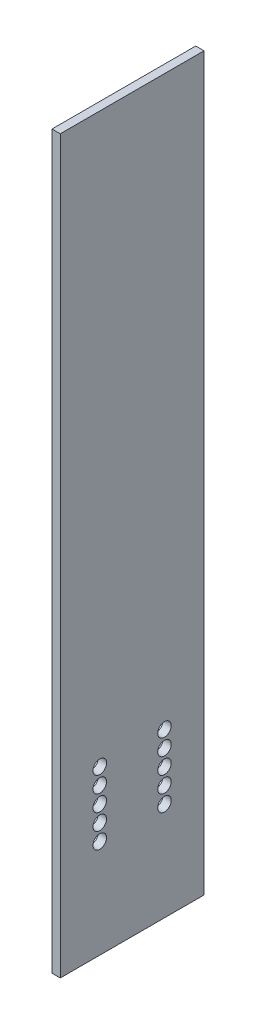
ISO-10303-21;
HEADER;
FILE_DESCRIPTION(('STEP AP214'),'2;1');
FILE_NAME('part.step','',(''),(''),'','','');
FILE_SCHEMA(('AUTOMOTIVE_DESIGN { 1 0 10303 214 1 1 1 1 }'));
ENDSEC;
DATA;
#1=APPLICATION_CONTEXT('core data for automotive mechanical design processes');
#2=APPLICATION_PROTOCOL_DEFINITION('international standard','automotive_design',2000,#1);
#3=PRODUCT_CONTEXT('',#1,'mechanical');
#4=PRODUCT('Part','Part','',(#3));
#5=PRODUCT_RELATED_PRODUCT_CATEGORY('part','',(#4));
#6=PRODUCT_DEFINITION_FORMATION('','',#4);
#7=PRODUCT_DEFINITION_CONTEXT('part definition',#1,'design');
#8=PRODUCT_DEFINITION('design','',#6,#7);
#9=PRODUCT_DEFINITION_SHAPE('','',#8);
#10=(LENGTH_UNIT() NAMED_UNIT(*) SI_UNIT(.MILLI.,.METRE.));
#11=(NAMED_UNIT(*) PLANE_ANGLE_UNIT() SI_UNIT($,.RADIAN.));
#12=(NAMED_UNIT(*) SI_UNIT($,.STERADIAN.) SOLID_ANGLE_UNIT());
#13=UNCERTAINTY_MEASURE_WITH_UNIT(LENGTH_MEASURE(1.E-05),#10,'distance_accuracy_value','');
#14=(GEOMETRIC_REPRESENTATION_CONTEXT(3) GLOBAL_UNCERTAINTY_ASSIGNED_CONTEXT((#13)) GLOBAL_UNIT_ASSIGNED_CONTEXT((#10,
#11,#12)) REPRESENTATION_CONTEXT('',''));
#15=CARTESIAN_POINT('',(0.,0.,0.));
#16=DIRECTION('',(0.,0.,1.));
#17=DIRECTION('',(1.,0.,0.));
#18=AXIS2_PLACEMENT_3D('',#15,#16,#17);
#19=CARTESIAN_POINT('',(3.2512,0.,0.));
#20=DIRECTION('',(1.,0.,0.));
#21=DIRECTION('',(0.,0.,-1.));
#22=AXIS2_PLACEMENT_3D('',#19,#20,#21);
#23=PLANE('',#22);
#24=CARTESIAN_POINT('',(3.2512,-79.4512,12.7));
#25=DIRECTION('',(-1.,0.,0.));
#26=DIRECTION('',(0.,0.,1.));
#27=AXIS2_PLACEMENT_3D('',#24,#25,#26);
#28=CIRCLE('',#27,2.6543);
#29=CARTESIAN_POINT('',(3.2512,-79.4512,15.3543));
#30=VERTEX_POINT('',#29);
#31=EDGE_CURVE('E193',#30,#30,#28,.T.);
#32=ORIENTED_EDGE('',*,*,#31,.T.);
#33=EDGE_LOOP('',(#32));
#34=FACE_BOUND('',#33,.T.);
#35=CARTESIAN_POINT('',(3.2512,-85.8012,12.7));
#36=DIRECTION('',(-1.,0.,0.));
#37=DIRECTION('',(0.,0.,1.));
#38=AXIS2_PLACEMENT_3D('',#35,#36,#37);
#39=CIRCLE('',#38,2.6543);
#40=CARTESIAN_POINT('',(3.2512,-85.8012,15.3543));
#41=VERTEX_POINT('',#40);
#42=EDGE_CURVE('E177',#41,#41,#39,.T.);
#43=ORIENTED_EDGE('',*,*,#42,.T.);
#44=EDGE_LOOP('',(#43));
#45=FACE_BOUND('',#44,.T.);
#46=DIRECTION('',(0.,1.,0.));
#47=VECTOR('',#46,1.);
#48=CARTESIAN_POINT('',(3.2512,143.51,-28.2194));
#49=LINE('',#48,#47);
#50=CARTESIAN_POINT('',(3.2512,-143.51,-28.2194));
#51=VERTEX_POINT('',#50);
#52=CARTESIAN_POINT('',(3.2512,143.51,-28.2194));
#53=VERTEX_POINT('',#52);
#54=EDGE_CURVE('E92',#51,#53,#49,.T.);
#55=ORIENTED_EDGE('',*,*,#54,.T.);
#56=DIRECTION('',(0.,0.,1.));
#57=VECTOR('',#56,1.);
#58=CARTESIAN_POINT('',(3.2512,143.51,28.2194));
#59=LINE('',#58,#57);
#60=CARTESIAN_POINT('',(3.2512,143.51,28.2194));
#61=VERTEX_POINT('',#60);
#62=EDGE_CURVE('E87',#53,#61,#59,.T.);
#63=ORIENTED_EDGE('',*,*,#62,.T.);
#64=DIRECTION('',(0.,-1.,0.));
#65=VECTOR('',#64,1.);
#66=CARTESIAN_POINT('',(3.2512,143.51,28.2194));
#67=LINE('',#66,#65);
#68=CARTESIAN_POINT('',(3.2512,-143.51,28.2194));
#69=VERTEX_POINT('',#68);
#70=EDGE_CURVE('E90',#61,#69,#67,.T.);
#71=ORIENTED_EDGE('',*,*,#70,.T.);
#72=DIRECTION('',(0.,0.,-1.));
#73=VECTOR('',#72,1.);
#74=CARTESIAN_POINT('',(3.2512,-143.51,28.2194));
#75=LINE('',#74,#73);
#76=EDGE_CURVE('E57',#69,#51,#75,.T.);
#77=ORIENTED_EDGE('',*,*,#76,.T.);
#78=EDGE_LOOP('',(#55,#63,#71,#77));
#79=FACE_BOUND('',#78,.T.);
#80=CARTESIAN_POINT('',(3.2512,-98.5012,12.7));
#81=DIRECTION('',(-1.,0.,0.));
#82=DIRECTION('',(0.,0.,1.));
#83=AXIS2_PLACEMENT_3D('',#80,#81,#82);
#84=CIRCLE('',#83,2.6543);
#85=CARTESIAN_POINT('',(3.2512,-98.5012,15.3543));
#86=VERTEX_POINT('',#85);
#87=EDGE_CURVE('E112',#86,#86,#84,.T.);
#88=ORIENTED_EDGE('',*,*,#87,.T.);
#89=EDGE_LOOP('',(#88));
#90=FACE_BOUND('',#89,.T.);
#91=CARTESIAN_POINT('',(3.2512,-98.5012,-12.7));
#92=DIRECTION('',(-1.,0.,0.));
#93=DIRECTION('',(0.,0.,1.));
#94=AXIS2_PLACEMENT_3D('',#91,#92,#93);
#95=CIRCLE('',#94,2.6543);
#96=CARTESIAN_POINT('',(3.2512,-98.5012,-10.0457));
#97=VERTEX_POINT('',#96);
#98=EDGE_CURVE('E137',#97,#97,#95,.T.);
#99=ORIENTED_EDGE('',*,*,#98,.T.);
#100=EDGE_LOOP('',(#99));
#101=FACE_BOUND('',#100,.T.);
#102=CARTESIAN_POINT('',(3.2512,-104.8512,12.7));
#103=DIRECTION('',(-1.,0.,0.));
#104=DIRECTION('',(0.,0.,1.));
#105=AXIS2_PLACEMENT_3D('',#102,#103,#104);
#106=CIRCLE('',#105,2.6543);
#107=CARTESIAN_POINT('',(3.2512,-104.8512,15.3543));
#108=VERTEX_POINT('',#107);
#109=EDGE_CURVE('E145',#108,#108,#106,.T.);
#110=ORIENTED_EDGE('',*,*,#109,.T.);
#111=EDGE_LOOP('',(#110));
#112=FACE_BOUND('',#111,.T.);
#113=CARTESIAN_POINT('',(3.2512,-104.8512,-12.7));
#114=DIRECTION('',(-1.,0.,0.));
#115=DIRECTION('',(0.,0.,1.));
#116=AXIS2_PLACEMENT_3D('',#113,#114,#115);
#117=CIRCLE('',#116,2.6543);
#118=CARTESIAN_POINT('',(3.2512,-104.8512,-10.0457));
#119=VERTEX_POINT('',#118);
#120=EDGE_CURVE('E153',#119,#119,#117,.T.);
#121=ORIENTED_EDGE('',*,*,#120,.T.);
#122=EDGE_LOOP('',(#121));
#123=FACE_BOUND('',#122,.T.);
#124=CARTESIAN_POINT('',(3.2512,-92.1512,12.7));
#125=DIRECTION('',(-1.,0.,0.));
#126=DIRECTION('',(0.,0.,1.));
#127=AXIS2_PLACEMENT_3D('',#124,#125,#126);
#128=CIRCLE('',#127,2.6543);
#129=CARTESIAN_POINT('',(3.2512,-92.1512,15.3543));
#130=VERTEX_POINT('',#129);
#131=EDGE_CURVE('E161',#130,#130,#128,.T.);
#132=ORIENTED_EDGE('',*,*,#131,.T.);
#133=EDGE_LOOP('',(#132));
#134=FACE_BOUND('',#133,.T.);
#135=CARTESIAN_POINT('',(3.2512,-92.1512,-12.7));
#136=DIRECTION('',(-1.,0.,0.));
#137=DIRECTION('',(0.,0.,1.));
#138=AXIS2_PLACEMENT_3D('',#135,#136,#137);
#139=CIRCLE('',#138,2.6543);
#140=CARTESIAN_POINT('',(3.2512,-92.1512,-10.0457));
#141=VERTEX_POINT('',#140);
#142=EDGE_CURVE('E169',#141,#141,#139,.T.);
#143=ORIENTED_EDGE('',*,*,#142,.T.);
#144=EDGE_LOOP('',(#143));
#145=FACE_BOUND('',#144,.T.);
#146=CARTESIAN_POINT('',(3.2512,-85.8012,-12.7));
#147=DIRECTION('',(-1.,0.,0.));
#148=DIRECTION('',(0.,0.,1.));
#149=AXIS2_PLACEMENT_3D('',#146,#147,#148);
#150=CIRCLE('',#149,2.6543);
#151=CARTESIAN_POINT('',(3.2512,-85.8012,-10.0457));
#152=VERTEX_POINT('',#151);
#153=EDGE_CURVE('E185',#152,#152,#150,.T.);
#154=ORIENTED_EDGE('',*,*,#153,.T.);
#155=EDGE_LOOP('',(#154));
#156=FACE_BOUND('',#155,.T.);
#157=CARTESIAN_POINT('',(3.2512,-79.4512,-12.7));
#158=DIRECTION('',(-1.,0.,0.));
#159=DIRECTION('',(0.,0.,1.));
#160=AXIS2_PLACEMENT_3D('',#157,#158,#159);
#161=CIRCLE('',#160,2.6543);
#162=CARTESIAN_POINT('',(3.2512,-79.4512,-10.0457));
#163=VERTEX_POINT('',#162);
#164=EDGE_CURVE('E201',#163,#163,#161,.T.);
#165=ORIENTED_EDGE('',*,*,#164,.T.);
#166=EDGE_LOOP('',(#165));
#167=FACE_BOUND('',#166,.T.);
#168=ADVANCED_FACE('F39',(#34,#45,#79,#90,#101,#112,#123,#134,#145,#156,#167),#23,.T.);
#169=CARTESIAN_POINT('',(0.,0.,0.));
#170=DIRECTION('',(1.,0.,0.));
#171=DIRECTION('',(0.,0.,-1.));
#172=AXIS2_PLACEMENT_3D('',#169,#170,#171);
#173=PLANE('',#172);
#174=CARTESIAN_POINT('',(0.,-79.4512,-12.7));
#175=DIRECTION('',(-1.,0.,0.));
#176=DIRECTION('',(0.,0.,1.));
#177=AXIS2_PLACEMENT_3D('',#174,#175,#176);
#178=CIRCLE('',#177,2.65429999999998);
#179=CARTESIAN_POINT('',(0.,-79.4512,-10.0457));
#180=VERTEX_POINT('',#179);
#181=EDGE_CURVE('E205',#180,#180,#178,.T.);
#182=ORIENTED_EDGE('',*,*,#181,.F.);
#183=EDGE_LOOP('',(#182));
#184=FACE_BOUND('',#183,.T.);
#185=CARTESIAN_POINT('',(0.,-79.4512,12.7));
#186=DIRECTION('',(-1.,0.,0.));
#187=DIRECTION('',(0.,0.,1.));
#188=AXIS2_PLACEMENT_3D('',#185,#186,#187);
#189=CIRCLE('',#188,2.65429999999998);
#190=CARTESIAN_POINT('',(0.,-79.4512,15.3543));
#191=VERTEX_POINT('',#190);
#192=EDGE_CURVE('E197',#191,#191,#189,.T.);
#193=ORIENTED_EDGE('',*,*,#192,.F.);
#194=EDGE_LOOP('',(#193));
#195=FACE_BOUND('',#194,.T.);
#196=CARTESIAN_POINT('',(0.,-85.8012,-12.7));
#197=DIRECTION('',(-1.,0.,0.));
#198=DIRECTION('',(0.,0.,1.));
#199=AXIS2_PLACEMENT_3D('',#196,#197,#198);
#200=CIRCLE('',#199,2.65429999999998);
#201=CARTESIAN_POINT('',(0.,-85.8012,-10.0457));
#202=VERTEX_POINT('',#201);
#203=EDGE_CURVE('E189',#202,#202,#200,.T.);
#204=ORIENTED_EDGE('',*,*,#203,.F.);
#205=EDGE_LOOP('',(#204));
#206=FACE_BOUND('',#205,.T.);
#207=CARTESIAN_POINT('',(0.,-85.8012,12.7));
#208=DIRECTION('',(-1.,0.,0.));
#209=DIRECTION('',(0.,0.,1.));
#210=AXIS2_PLACEMENT_3D('',#207,#208,#209);
#211=CIRCLE('',#210,2.65429999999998);
#212=CARTESIAN_POINT('',(0.,-85.8012,15.3543));
#213=VERTEX_POINT('',#212);
#214=EDGE_CURVE('E181',#213,#213,#211,.T.);
#215=ORIENTED_EDGE('',*,*,#214,.F.);
#216=EDGE_LOOP('',(#215));
#217=FACE_BOUND('',#216,.T.);
#218=CARTESIAN_POINT('',(0.,-92.1512,-12.7));
#219=DIRECTION('',(-1.,0.,0.));
#220=DIRECTION('',(0.,0.,1.));
#221=AXIS2_PLACEMENT_3D('',#218,#219,#220);
#222=CIRCLE('',#221,2.65429999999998);
#223=CARTESIAN_POINT('',(0.,-92.1512,-10.0457));
#224=VERTEX_POINT('',#223);
#225=EDGE_CURVE('E173',#224,#224,#222,.T.);
#226=ORIENTED_EDGE('',*,*,#225,.F.);
#227=EDGE_LOOP('',(#226));
#228=FACE_BOUND('',#227,.T.);
#229=CARTESIAN_POINT('',(0.,-104.8512,-12.7));
#230=DIRECTION('',(-1.,0.,0.));
#231=DIRECTION('',(0.,0.,1.));
#232=AXIS2_PLACEMENT_3D('',#229,#230,#231);
#233=CIRCLE('',#232,2.65429999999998);
#234=CARTESIAN_POINT('',(0.,-104.8512,-10.0457));
#235=VERTEX_POINT('',#234);
#236=EDGE_CURVE('E157',#235,#235,#233,.T.);
#237=ORIENTED_EDGE('',*,*,#236,.F.);
#238=EDGE_LOOP('',(#237));
#239=FACE_BOUND('',#238,.T.);
#240=CARTESIAN_POINT('',(0.,-104.8512,12.7));
#241=DIRECTION('',(-1.,0.,0.));
#242=DIRECTION('',(0.,0.,1.));
#243=AXIS2_PLACEMENT_3D('',#240,#241,#242);
#244=CIRCLE('',#243,2.65429999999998);
#245=CARTESIAN_POINT('',(0.,-104.8512,15.3543));
#246=VERTEX_POINT('',#245);
#247=EDGE_CURVE('E149',#246,#246,#244,.T.);
#248=ORIENTED_EDGE('',*,*,#247,.F.);
#249=EDGE_LOOP('',(#248));
#250=FACE_BOUND('',#249,.T.);
#251=CARTESIAN_POINT('',(0.,-98.5012,-12.7));
#252=DIRECTION('',(-1.,0.,0.));
#253=DIRECTION('',(0.,0.,1.));
#254=AXIS2_PLACEMENT_3D('',#251,#252,#253);
#255=CIRCLE('',#254,2.65429999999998);
#256=CARTESIAN_POINT('',(0.,-98.5012,-10.0457));
#257=VERTEX_POINT('',#256);
#258=EDGE_CURVE('E141',#257,#257,#255,.T.);
#259=ORIENTED_EDGE('',*,*,#258,.F.);
#260=EDGE_LOOP('',(#259));
#261=FACE_BOUND('',#260,.T.);
#262=CARTESIAN_POINT('',(0.,-98.5012,12.7));
#263=DIRECTION('',(-1.,0.,0.));
#264=DIRECTION('',(0.,0.,1.));
#265=AXIS2_PLACEMENT_3D('',#262,#263,#264);
#266=CIRCLE('',#265,2.65429999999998);
#267=CARTESIAN_POINT('',(0.,-98.5012,15.3543));
#268=VERTEX_POINT('',#267);
#269=EDGE_CURVE('E133',#268,#268,#266,.T.);
#270=ORIENTED_EDGE('',*,*,#269,.F.);
#271=EDGE_LOOP('',(#270));
#272=FACE_BOUND('',#271,.T.);
#273=DIRECTION('',(0.,1.,0.));
#274=VECTOR('',#273,1.);
#275=CARTESIAN_POINT('',(0.,143.51,-28.2194));
#276=LINE('',#275,#274);
#277=CARTESIAN_POINT('',(0.,-143.51,-28.2194));
#278=VERTEX_POINT('',#277);
#279=CARTESIAN_POINT('',(0.,143.51,-28.2194));
#280=VERTEX_POINT('',#279);
#281=EDGE_CURVE('E108',#278,#280,#276,.T.);
#282=ORIENTED_EDGE('',*,*,#281,.F.);
#283=DIRECTION('',(0.,0.,-1.));
#284=VECTOR('',#283,1.);
#285=CARTESIAN_POINT('',(0.,-143.51,28.2194));
#286=LINE('',#285,#284);
#287=CARTESIAN_POINT('',(0.,-143.51,28.2194));
#288=VERTEX_POINT('',#287);
#289=EDGE_CURVE('E80',#288,#278,#286,.T.);
#290=ORIENTED_EDGE('',*,*,#289,.F.);
#291=DIRECTION('',(0.,-1.,0.));
#292=VECTOR('',#291,1.);
#293=CARTESIAN_POINT('',(0.,143.51,28.2194));
#294=LINE('',#293,#292);
#295=CARTESIAN_POINT('',(0.,143.51,28.2194));
#296=VERTEX_POINT('',#295);
#297=EDGE_CURVE('E74',#296,#288,#294,.T.);
#298=ORIENTED_EDGE('',*,*,#297,.F.);
#299=DIRECTION('',(0.,0.,1.));
#300=VECTOR('',#299,1.);
#301=CARTESIAN_POINT('',(0.,143.51,28.2194));
#302=LINE('',#301,#300);
#303=EDGE_CURVE('E97',#280,#296,#302,.T.);
#304=ORIENTED_EDGE('',*,*,#303,.F.);
#305=EDGE_LOOP('',(#282,#290,#298,#304));
#306=FACE_BOUND('',#305,.T.);
#307=CARTESIAN_POINT('',(0.,-92.1512,12.7));
#308=DIRECTION('',(-1.,0.,0.));
#309=DIRECTION('',(0.,0.,1.));
#310=AXIS2_PLACEMENT_3D('',#307,#308,#309);
#311=CIRCLE('',#310,2.65429999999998);
#312=CARTESIAN_POINT('',(0.,-92.1512,15.3543));
#313=VERTEX_POINT('',#312);
#314=EDGE_CURVE('E165',#313,#313,#311,.T.);
#315=ORIENTED_EDGE('',*,*,#314,.F.);
#316=EDGE_LOOP('',(#315));
#317=FACE_BOUND('',#316,.T.);
#318=ADVANCED_FACE('F125',(#184,#195,#206,#217,#228,#239,#250,#261,#272,#306,#317),#173,.F.);
#319=CARTESIAN_POINT('',(3.2512,143.51,-28.2194));
#320=DIRECTION('',(0.,0.,1.));
#321=DIRECTION('',(0.,-1.,0.));
#322=AXIS2_PLACEMENT_3D('',#319,#320,#321);
#323=PLANE('',#322);
#324=ORIENTED_EDGE('',*,*,#281,.T.);
#325=DIRECTION('',(-1.,0.,0.));
#326=VECTOR('',#325,1.);
#327=CARTESIAN_POINT('',(3.2512,143.51,-28.2194));
#328=LINE('',#327,#326);
#329=EDGE_CURVE('E11',#53,#280,#328,.T.);
#330=ORIENTED_EDGE('',*,*,#329,.F.);
#331=ORIENTED_EDGE('',*,*,#54,.F.);
#332=DIRECTION('',(-1.,0.,0.));
#333=VECTOR('',#332,1.);
#334=CARTESIAN_POINT('',(3.2512,-143.51,-28.2194));
#335=LINE('',#334,#333);
#336=EDGE_CURVE('E104',#51,#278,#335,.T.);
#337=ORIENTED_EDGE('',*,*,#336,.T.);
#338=EDGE_LOOP('',(#324,#330,#331,#337));
#339=FACE_BOUND('',#338,.T.);
#340=ADVANCED_FACE('F41',(#339),#323,.F.);
#341=CARTESIAN_POINT('',(3.2512,143.51,28.2194));
#342=DIRECTION('',(0.,-1.,0.));
#343=DIRECTION('',(0.,0.,-1.));
#344=AXIS2_PLACEMENT_3D('',#341,#342,#343);
#345=PLANE('',#344);
#346=ORIENTED_EDGE('',*,*,#303,.T.);
#347=DIRECTION('',(-1.,0.,0.));
#348=VECTOR('',#347,1.);
#349=CARTESIAN_POINT('',(3.2512,143.51,28.2194));
#350=LINE('',#349,#348);
#351=EDGE_CURVE('E49',#61,#296,#350,.T.);
#352=ORIENTED_EDGE('',*,*,#351,.F.);
#353=ORIENTED_EDGE('',*,*,#62,.F.);
#354=ORIENTED_EDGE('',*,*,#329,.T.);
#355=EDGE_LOOP('',(#346,#352,#353,#354));
#356=FACE_BOUND('',#355,.T.);
#357=ADVANCED_FACE('F96',(#356),#345,.F.);
#358=CARTESIAN_POINT('',(3.2512,143.51,28.2194));
#359=DIRECTION('',(0.,0.,-1.));
#360=DIRECTION('',(0.,1.,0.));
#361=AXIS2_PLACEMENT_3D('',#358,#359,#360);
#362=PLANE('',#361);
#363=ORIENTED_EDGE('',*,*,#297,.T.);
#364=DIRECTION('',(-1.,0.,0.));
#365=VECTOR('',#364,1.);
#366=CARTESIAN_POINT('',(3.2512,-143.51,28.2194));
#367=LINE('',#366,#365);
#368=EDGE_CURVE('E99',#69,#288,#367,.T.);
#369=ORIENTED_EDGE('',*,*,#368,.F.);
#370=ORIENTED_EDGE('',*,*,#70,.F.);
#371=ORIENTED_EDGE('',*,*,#351,.T.);
#372=EDGE_LOOP('',(#363,#369,#370,#371));
#373=FACE_BOUND('',#372,.T.);
#374=ADVANCED_FACE('F100',(#373),#362,.F.);
#375=CARTESIAN_POINT('',(3.2512,-143.51,28.2194));
#376=DIRECTION('',(0.,1.,0.));
#377=DIRECTION('',(0.,0.,1.));
#378=AXIS2_PLACEMENT_3D('',#375,#376,#377);
#379=PLANE('',#378);
#380=ORIENTED_EDGE('',*,*,#289,.T.);
#381=ORIENTED_EDGE('',*,*,#336,.F.);
#382=ORIENTED_EDGE('',*,*,#76,.F.);
#383=ORIENTED_EDGE('',*,*,#368,.T.);
#384=EDGE_LOOP('',(#380,#381,#382,#383));
#385=FACE_BOUND('',#384,.T.);
#386=ADVANCED_FACE('F122',(#385),#379,.F.);
#387=CARTESIAN_POINT('',(0.,-98.5012,12.7));
#388=DIRECTION('',(-1.,0.,0.));
#389=DIRECTION('',(0.,0.,1.));
#390=AXIS2_PLACEMENT_3D('',#387,#388,#389);
#391=CYLINDRICAL_SURFACE('',#390,2.65429999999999);
#392=ORIENTED_EDGE('',*,*,#87,.F.);
#393=EDGE_LOOP('',(#392));
#394=FACE_BOUND('',#393,.T.);
#395=ORIENTED_EDGE('',*,*,#269,.T.);
#396=EDGE_LOOP('',(#395));
#397=FACE_BOUND('',#396,.T.);
#398=ADVANCED_FACE('F231',(#394,#397),#391,.F.);
#399=CARTESIAN_POINT('',(0.,-98.5012,-12.7));
#400=DIRECTION('',(-1.,0.,0.));
#401=DIRECTION('',(0.,0.,1.));
#402=AXIS2_PLACEMENT_3D('',#399,#400,#401);
#403=CYLINDRICAL_SURFACE('',#402,2.65429999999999);
#404=ORIENTED_EDGE('',*,*,#98,.F.);
#405=EDGE_LOOP('',(#404));
#406=FACE_BOUND('',#405,.T.);
#407=ORIENTED_EDGE('',*,*,#258,.T.);
#408=EDGE_LOOP('',(#407));
#409=FACE_BOUND('',#408,.T.);
#410=ADVANCED_FACE('F233',(#406,#409),#403,.F.);
#411=CARTESIAN_POINT('',(0.,-104.8512,12.7));
#412=DIRECTION('',(-1.,0.,0.));
#413=DIRECTION('',(0.,0.,1.));
#414=AXIS2_PLACEMENT_3D('',#411,#412,#413);
#415=CYLINDRICAL_SURFACE('',#414,2.65429999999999);
#416=ORIENTED_EDGE('',*,*,#109,.F.);
#417=EDGE_LOOP('',(#416));
#418=FACE_BOUND('',#417,.T.);
#419=ORIENTED_EDGE('',*,*,#247,.T.);
#420=EDGE_LOOP('',(#419));
#421=FACE_BOUND('',#420,.T.);
#422=ADVANCED_FACE('F240',(#418,#421),#415,.F.);
#423=CARTESIAN_POINT('',(0.,-104.8512,-12.7));
#424=DIRECTION('',(-1.,0.,0.));
#425=DIRECTION('',(0.,0.,1.));
#426=AXIS2_PLACEMENT_3D('',#423,#424,#425);
#427=CYLINDRICAL_SURFACE('',#426,2.65429999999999);
#428=ORIENTED_EDGE('',*,*,#120,.F.);
#429=EDGE_LOOP('',(#428));
#430=FACE_BOUND('',#429,.T.);
#431=ORIENTED_EDGE('',*,*,#236,.T.);
#432=EDGE_LOOP('',(#431));
#433=FACE_BOUND('',#432,.T.);
#434=ADVANCED_FACE('F296',(#430,#433),#427,.F.);
#435=CARTESIAN_POINT('',(0.,-92.1512,12.7));
#436=DIRECTION('',(-1.,0.,0.));
#437=DIRECTION('',(0.,0.,1.));
#438=AXIS2_PLACEMENT_3D('',#435,#436,#437);
#439=CYLINDRICAL_SURFACE('',#438,2.65429999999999);
#440=ORIENTED_EDGE('',*,*,#131,.F.);
#441=EDGE_LOOP('',(#440));
#442=FACE_BOUND('',#441,.T.);
#443=ORIENTED_EDGE('',*,*,#314,.T.);
#444=EDGE_LOOP('',(#443));
#445=FACE_BOUND('',#444,.T.);
#446=ADVANCED_FACE('F304',(#442,#445),#439,.F.);
#447=CARTESIAN_POINT('',(0.,-92.1512,-12.7));
#448=DIRECTION('',(-1.,0.,0.));
#449=DIRECTION('',(0.,0.,1.));
#450=AXIS2_PLACEMENT_3D('',#447,#448,#449);
#451=CYLINDRICAL_SURFACE('',#450,2.65429999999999);
#452=ORIENTED_EDGE('',*,*,#142,.F.);
#453=EDGE_LOOP('',(#452));
#454=FACE_BOUND('',#453,.T.);
#455=ORIENTED_EDGE('',*,*,#225,.T.);
#456=EDGE_LOOP('',(#455));
#457=FACE_BOUND('',#456,.T.);
#458=ADVANCED_FACE('F312',(#454,#457),#451,.F.);
#459=CARTESIAN_POINT('',(0.,-85.8012,12.7));
#460=DIRECTION('',(-1.,0.,0.));
#461=DIRECTION('',(0.,0.,1.));
#462=AXIS2_PLACEMENT_3D('',#459,#460,#461);
#463=CYLINDRICAL_SURFACE('',#462,2.65429999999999);
#464=ORIENTED_EDGE('',*,*,#42,.F.);
#465=EDGE_LOOP('',(#464));
#466=FACE_BOUND('',#465,.T.);
#467=ORIENTED_EDGE('',*,*,#214,.T.);
#468=EDGE_LOOP('',(#467));
#469=FACE_BOUND('',#468,.T.);
#470=ADVANCED_FACE('F320',(#466,#469),#463,.F.);
#471=CARTESIAN_POINT('',(0.,-85.8012,-12.7));
#472=DIRECTION('',(-1.,0.,0.));
#473=DIRECTION('',(0.,0.,1.));
#474=AXIS2_PLACEMENT_3D('',#471,#472,#473);
#475=CYLINDRICAL_SURFACE('',#474,2.65429999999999);
#476=ORIENTED_EDGE('',*,*,#153,.F.);
#477=EDGE_LOOP('',(#476));
#478=FACE_BOUND('',#477,.T.);
#479=ORIENTED_EDGE('',*,*,#203,.T.);
#480=EDGE_LOOP('',(#479));
#481=FACE_BOUND('',#480,.T.);
#482=ADVANCED_FACE('F328',(#478,#481),#475,.F.);
#483=CARTESIAN_POINT('',(0.,-79.4512,12.7));
#484=DIRECTION('',(-1.,0.,0.));
#485=DIRECTION('',(0.,0.,1.));
#486=AXIS2_PLACEMENT_3D('',#483,#484,#485);
#487=CYLINDRICAL_SURFACE('',#486,2.65429999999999);
#488=ORIENTED_EDGE('',*,*,#31,.F.);
#489=EDGE_LOOP('',(#488));
#490=FACE_BOUND('',#489,.T.);
#491=ORIENTED_EDGE('',*,*,#192,.T.);
#492=EDGE_LOOP('',(#491));
#493=FACE_BOUND('',#492,.T.);
#494=ADVANCED_FACE('F336',(#490,#493),#487,.F.);
#495=CARTESIAN_POINT('',(0.,-79.4512,-12.7));
#496=DIRECTION('',(-1.,0.,0.));
#497=DIRECTION('',(0.,0.,1.));
#498=AXIS2_PLACEMENT_3D('',#495,#496,#497);
#499=CYLINDRICAL_SURFACE('',#498,2.65429999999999);
#500=ORIENTED_EDGE('',*,*,#164,.F.);
#501=EDGE_LOOP('',(#500));
#502=FACE_BOUND('',#501,.T.);
#503=ORIENTED_EDGE('',*,*,#181,.T.);
#504=EDGE_LOOP('',(#503));
#505=FACE_BOUND('',#504,.T.);
#506=ADVANCED_FACE('F210',(#502,#505),#499,.F.);
#507=CLOSED_SHELL('',(#168,#318,#340,#357,#374,#386,#398,#410,#422,#434,#446,#458,#470,#482,
#494,#506));
#508=MANIFOLD_SOLID_BREP('B2',#507);
#509=ADVANCED_BREP_SHAPE_REPRESENTATION('',(#18,#508),#14);
#510=SHAPE_DEFINITION_REPRESENTATION(#9,#509);
ENDSEC;
END-ISO-10303-21;
